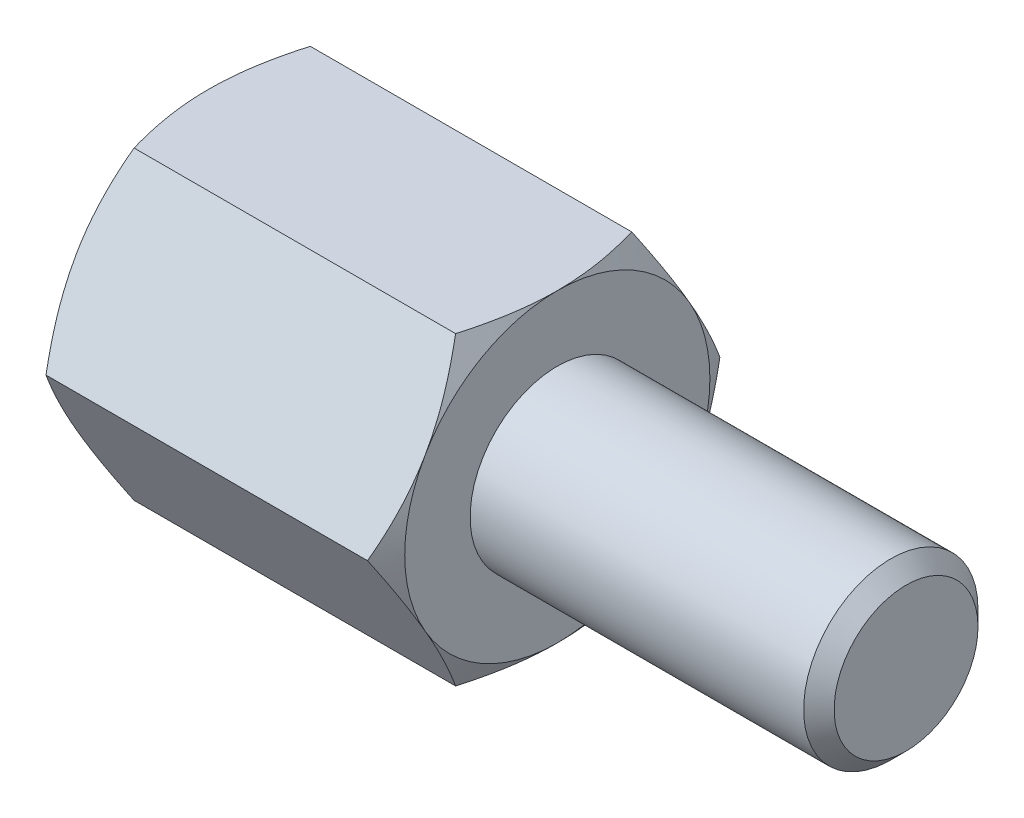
from build123d import *

# Parameters (mm, degrees)
EXTRUDE2_DEPTH = 4
SKETCH3_R      = 1.65
EXTRUDE3_DEPTH = 5
SKETCH5_R      = 2
EXTRUDE4_DEPTH = 8
CHAMFER1_SIZE  = 0.35


with BuildPart() as part:
    # Sketch1 → Extrude2 (new, symmetric)
    with BuildSketch(Plane(origin=(0, 0, 0), x_dir=(0, 0, -1), z_dir=(1, 0, 0))):
        Polygon((2.020725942, 3.5), (-2.020725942, 3.5), (-4.041451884, 0), (-2.020725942, -3.5), (2.020725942, -3.5), (4.041451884, 0), align=None)
    extrude(amount=EXTRUDE2_DEPTH, both=True)

    # Sketch2 → Cut-Revolve1 (revolve, cut)
    with BuildSketch(Plane.XY):
        with BuildLine():
            Line((-4, 3.5), (-2.5, 6.098076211))
            ThreePointArc((-2.5, 6.098076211), (-2.98810136, 7.276457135), (-4, 6.5))
            Line((-4, 6.5), (-4, 3.5))
        make_face()
    cut_revolve1 = revolve(axis=Axis((0, 0, 0), (1, 0, 0)), mode=Mode.SUBTRACT)

    # Mirror1: Cut-Revolve1 across plane
    add(cut_revolve1.mirror(Plane(origin=(0, 0, 0), x_dir=(0, 0, 1), z_dir=(1, 0, 0))), mode=Mode.SUBTRACT)

    # Sketch3 → Extrude3 (cut)
    with BuildSketch(Plane.ZY.offset(4)):
        Circle(SKETCH3_R)
    extrude(amount=-EXTRUDE3_DEPTH, mode=Mode.SUBTRACT)

    # Sketch4 → Cut-Revolve2 (revolve, cut)
    with BuildSketch(Plane.XY, mode=Mode.PRIVATE) as cut_revolve2_sk:
        Polygon((1, 0), (1, 1.65), (1.952627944, 0), align=None)
    revolve(cut_revolve2_sk.sketch.rotate(Axis((1.952627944, 0, 0), (-1, 0, 0)), 270), axis=Axis((1.952627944, 0, 0), (-1, 0, 0)), mode=Mode.SUBTRACT)

    # Sketch5 → Extrude4 (add)
    with BuildSketch(Plane(origin=(4, 0, 0), x_dir=(0, 0, -1), z_dir=(1, 0, 0))):
        Circle(SKETCH5_R)
    extrude(amount=EXTRUDE4_DEPTH)

    # Chamfer1
    chamfer1_edges = [part.edges().sort_by_distance(p)[0] for p in [
        (12, 0, 2),
    ]]
    chamfer(chamfer1_edges, length=CHAMFER1_SIZE)


solid = part.part
